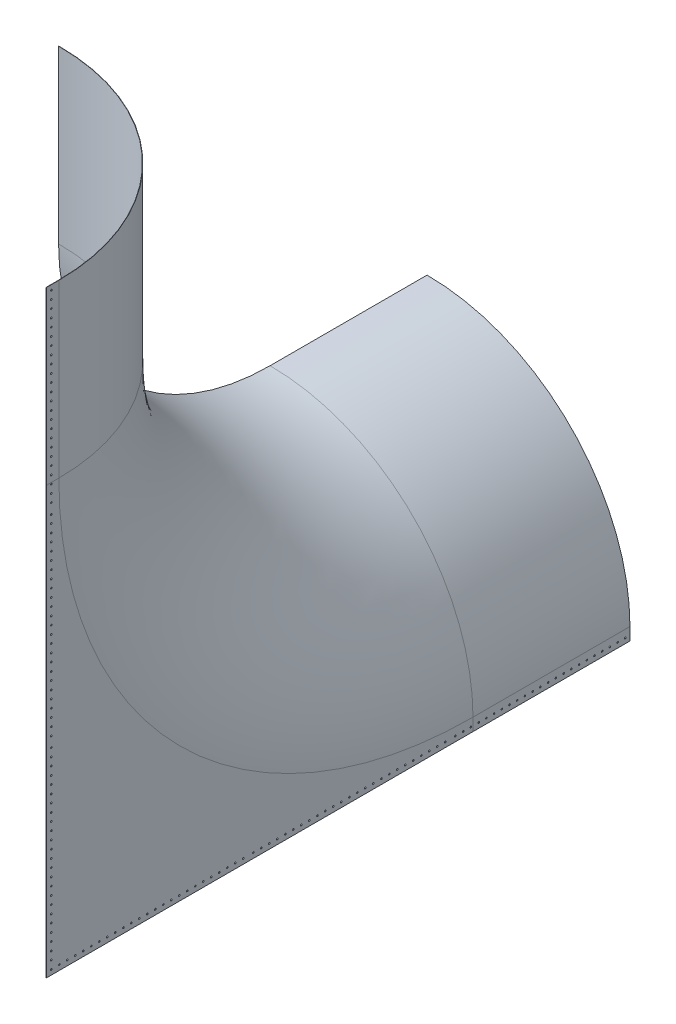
from build123d import *

# Parameters (mm, degrees)
BOSS_EXTRUDE1_DEPTH     = 1.5875
BOSS_EXTRUDE2_DEPTH     = 920.7377971
BOSS_EXTRUDE3_START     = 1006.9599971
BOSS_EXTRUDE3_DEPTH     = 1006.9599971
SKETCH3_R               = 4.826
CUT_EXTRUDE1_DEPTH      = 10
CUT_EXTRUDE2_DEPTH      = 4621.606419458
CUT_EXTRUDE2_DEPTH_BACK = 4621.606419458
SKETCH5_W               = 4335.241922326
SKETCH5_H               = 3795.113420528
CUT_EXTRUDE3_DEPTH      = 88


with BuildPart() as part:
    # Sweep1: sweep along a path in Corner Arch
    with BuildLine(Plane.YZ) as sweep1_path:
        Line((0, 0), (0, 75.7422029))
        ThreePointArc((0, 75.7422029), (731.881575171, 1842.660627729), (2498.8, 2574.5422029))
        Line((2498.8, 2574.5422029), (2574.5422029, 2574.5422029))
    # sk 48.2in rad pnl → Sweep1 (sweep)
    with BuildSketch(Plane(origin=(0, 0, 0), x_dir=(0, 1, 0), z_dir=(0, 0, 1))):
        with BuildLine():
            Line((1222.6925, 0), (1222.6925, 75.746594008))
            Line((1222.6925, 75.746594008), (1224.28, 75.746594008))
            Line((1224.28, 75.746594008), (1224.28, 0))
            ThreePointArc((1224.28, 0), (865.696690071, -865.696690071), (0, -1224.28))
            Line((0, -1224.28), (-75.737811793, -1224.28))
            Line((-75.737811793, -1224.28), (-75.737811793, -1222.6925))
            Line((-75.737811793, -1222.6925), (0, -1222.6925))
            ThreePointArc((0, -1222.6925), (864.574158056, -864.574158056), (1222.6925, 0))
        make_face()
    sweep(path=sweep1_path.line)

    # Sketch1 → Boss-Extrude1 (add)
    with BuildSketch(Plane.YZ.offset(1224.28)):
        with BuildLine():
            Line((2498.8, 2650.280014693), (-75.737811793, 2650.280014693))
            Line((-75.737811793, 2650.280014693), (-75.737811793, 75.7422029))
            ThreePointArc((-75.737811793, 75.7422029), (678.32685486, 1896.21534804), (2498.8, 2650.280014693))
        make_face()
    extrude(amount=-BOSS_EXTRUDE1_DEPTH)

    # sk 48.2in rad pnl_2 → Boss-Extrude2 (add)
    with BuildSketch(Plane(origin=(0, 0, 0), x_dir=(0, 1, 0), z_dir=(0, 0, 1))):
        with BuildLine():
            Line((1222.6925, 0), (1222.6925, 75.746594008))
            Line((1222.6925, 75.746594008), (1224.28, 75.746594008))
            Line((1224.28, 75.746594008), (1224.28, 0))
            ThreePointArc((1224.28, 0), (865.696690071, -865.696690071), (0, -1224.28))
            Line((0, -1224.28), (-75.737811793, -1224.28))
            Line((-75.737811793, -1224.28), (-75.737811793, -1222.6925))
            Line((-75.737811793, -1222.6925), (0, -1222.6925))
            ThreePointArc((0, -1222.6925), (864.574158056, -864.574158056), (1222.6925, 0))
        make_face()
    extrude(amount=-BOSS_EXTRUDE2_DEPTH)

    # Sketch2 → Boss-Extrude3 (add)
    with BuildSketch(Plane(origin=(0, 2574.5422029, 0), x_dir=(-1, 0, 0), z_dir=(0, 1, 0)).offset(BOSS_EXTRUDE3_START)):
        with BuildLine():
            Line((-1224.28, 2650.280014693), (-1224.28, 2574.5422029))
            ThreePointArc((-1224.28, 2574.5422029), (-865.696690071, 1708.845512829), (0, 1350.2622029))
            Line((0, 1350.2622029), (75.746594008, 1350.2622029))
            Line((75.746594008, 1350.2622029), (75.746594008, 1351.8497029))
            Line((75.746594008, 1351.8497029), (0, 1351.8497029))
            ThreePointArc((0, 1351.8497029), (-864.574158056, 1709.968044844), (-1222.6925, 2574.5422029))
            Line((-1222.6925, 2574.5422029), (-1222.6925, 2650.280014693))
            Line((-1222.6925, 2650.280014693), (-1224.28, 2650.280014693))
        make_face()
    extrude(amount=-BOSS_EXTRUDE3_DEPTH)

    # Sketch3 → Cut-Extrude1 (cut)
    with BuildSketch(Plane.YZ.offset(1224.28)):
        with Locations(Location((-45.435611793, -890.4355971, 0), (0, 0, 180))):
            Circle(SKETCH3_R)
        with Locations(Location((-45.435611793, -843.8183971, 0), (0, 0, 180))):
            Circle(SKETCH3_R)
        with Locations(Location((-45.435611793, -797.2011971, 0), (0, 0, 180))):
            Circle(SKETCH3_R)
        with Locations(Location((-45.435611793, -750.5839971, 0), (0, 0, 180))):
            Circle(SKETCH3_R)
        with Locations(Location((-45.435611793, -703.9667971, 0), (0, 0, 180))):
            Circle(SKETCH3_R)
        with Locations(Location((-45.435611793, -657.3495971, 0), (0, 0, 180))):
            Circle(SKETCH3_R)
        with Locations(Location((-45.435611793, -610.7323971, 0), (0, 0, 180))):
            Circle(SKETCH3_R)
        with Locations(Location((-45.435611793, -564.1151971, 0), (0, 0, 180))):
            Circle(SKETCH3_R)
        with Locations(Location((-45.435611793, -517.4979971, 0), (0, 0, 180))):
            Circle(SKETCH3_R)
        with Locations(Location((-45.435611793, -470.8807971, 0), (0, 0, 180))):
            Circle(SKETCH3_R)
        with Locations(Location((-45.435611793, -424.2635971, 0), (0, 0, 180))):
            Circle(SKETCH3_R)
        with Locations(Location((-45.435611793, -377.6463971, 0), (0, 0, 180))):
            Circle(SKETCH3_R)
        with Locations(Location((-45.435611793, -331.0291971, 0), (0, 0, 180))):
            Circle(SKETCH3_R)
        with Locations(Location((-45.435611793, -284.4119971, 0), (0, 0, 180))):
            Circle(SKETCH3_R)
        with Locations(Location((-45.435611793, -237.7947971, 0), (0, 0, 180))):
            Circle(SKETCH3_R)
        with Locations(Location((-45.435611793, -191.1775971, 0), (0, 0, 180))):
            Circle(SKETCH3_R)
        with Locations(Location((-45.435611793, -144.5603971, 0), (0, 0, 180))):
            Circle(SKETCH3_R)
        with Locations(Location((-45.435611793, -97.9431971, 0), (0, 0, 180))):
            Circle(SKETCH3_R)
        with Locations(Location((-45.435611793, -51.3259971, 0), (0, 0, 180))):
            Circle(SKETCH3_R)
        with Locations(Location((-45.435611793, -4.7087971, 0), (0, 0, 180))):
            Circle(SKETCH3_R)
        with Locations(Location((-45.435611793, 41.9084029, 0), (0, 0, 180))):
            Circle(SKETCH3_R)
        with Locations(Location((-45.435611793, 88.5256029, 0), (0, 0, 180))):
            Circle(SKETCH3_R)
        with Locations(Location((-45.435611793, 135.1428029, 0), (0, 0, 180))):
            Circle(SKETCH3_R)
        with Locations(Location((-45.435611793, 181.7600029, 0), (0, 0, 180))):
            Circle(SKETCH3_R)
        with Locations(Location((-45.435611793, 242.7200029, 0), (0, 0, 180))):
            Circle(SKETCH3_R)
        with Locations(Location((-45.435611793, 290.9800029, 0), (0, 0, 180))):
            Circle(SKETCH3_R)
        with Locations(Location((-45.435611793, 339.2400029, 0), (0, 0, 180))):
            Circle(SKETCH3_R)
        with Locations(Location((-45.435611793, 387.5000029, 0), (0, 0, 180))):
            Circle(SKETCH3_R)
        with Locations(Location((-45.435611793, 435.7600029, 0), (0, 0, 180))):
            Circle(SKETCH3_R)
        with Locations(Location((-45.435611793, 484.0200029, 0), (0, 0, 180))):
            Circle(SKETCH3_R)
        with Locations(Location((-45.435611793, 532.2800029, 0), (0, 0, 180))):
            Circle(SKETCH3_R)
        with Locations(Location((-45.435611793, 580.5400029, 0), (0, 0, 180))):
            Circle(SKETCH3_R)
        with Locations(Location((-45.435611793, 628.8000029, 0), (0, 0, 180))):
            Circle(SKETCH3_R)
        with Locations(Location((-45.435611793, 677.0600029, 0), (0, 0, 180))):
            Circle(SKETCH3_R)
        with Locations(Location((-45.435611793, 725.3200029, 0), (0, 0, 180))):
            Circle(SKETCH3_R)
        with Locations(Location((-45.435611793, 773.5800029, 0), (0, 0, 180))):
            Circle(SKETCH3_R)
        with Locations(Location((-45.435611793, 821.8400029, 0), (0, 0, 180))):
            Circle(SKETCH3_R)
        with Locations(Location((-45.435611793, 870.1000029, 0), (0, 0, 180))):
            Circle(SKETCH3_R)
        with Locations(Location((-45.435611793, 918.3600029, 0), (0, 0, 180))):
            Circle(SKETCH3_R)
        with Locations(Location((-45.435611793, 966.6200029, 0), (0, 0, 180))):
            Circle(SKETCH3_R)
        with Locations(Location((-45.435611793, 1014.8800029, 0), (0, 0, 180))):
            Circle(SKETCH3_R)
        with Locations(Location((-45.435611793, 1063.1400029, 0), (0, 0, 180))):
            Circle(SKETCH3_R)
        with Locations(Location((-45.435611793, 1111.4000029, 0), (0, 0, 180))):
            Circle(SKETCH3_R)
        with Locations(Location((-45.435611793, 1159.6600029, 0), (0, 0, 180))):
            Circle(SKETCH3_R)
        with Locations(Location((-45.435611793, 1207.9200029, 0), (0, 0, 180))):
            Circle(SKETCH3_R)
        with Locations(Location((-45.435611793, 1256.1800029, 0), (0, 0, 180))):
            Circle(SKETCH3_R)
        with Locations(Location((-45.435611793, 1304.4400029, 0), (0, 0, 180))):
            Circle(SKETCH3_R)
        with Locations(Location((-45.435611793, 1352.7000029, 0), (0, 0, 180))):
            Circle(SKETCH3_R)
        with Locations(Location((-45.435611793, 1400.9600029, 0), (0, 0, 180))):
            Circle(SKETCH3_R)
        with Locations(Location((-45.435611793, 1461.7422029, 0), (0, 0, 180))):
            Circle(SKETCH3_R)
        with Locations(Location((-45.435611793, 1510.0022029, 0), (0, 0, 180))):
            Circle(SKETCH3_R)
        with Locations(Location((-45.435611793, 1558.2622029, 0), (0, 0, 180))):
            Circle(SKETCH3_R)
        with Locations(Location((-45.435611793, 1606.5222029, 0), (0, 0, 180))):
            Circle(SKETCH3_R)
        with Locations(Location((-45.435611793, 1654.7822029, 0), (0, 0, 180))):
            Circle(SKETCH3_R)
        with Locations(Location((-45.435611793, 1703.0422029, 0), (0, 0, 180))):
            Circle(SKETCH3_R)
        with Locations(Location((-45.435611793, 1751.3022029, 0), (0, 0, 180))):
            Circle(SKETCH3_R)
        with Locations(Location((-45.435611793, 1799.5622029, 0), (0, 0, 180))):
            Circle(SKETCH3_R)
        with Locations(Location((-45.435611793, 1847.8222029, 0), (0, 0, 180))):
            Circle(SKETCH3_R)
        with Locations(Location((-45.435611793, 1896.0822029, 0), (0, 0, 180))):
            Circle(SKETCH3_R)
        with Locations(Location((-45.435611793, 1944.3422029, 0), (0, 0, 180))):
            Circle(SKETCH3_R)
        with Locations(Location((-45.435611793, 1992.6022029, 0), (0, 0, 180))):
            Circle(SKETCH3_R)
        with Locations(Location((-45.435611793, 2040.8622029, 0), (0, 0, 180))):
            Circle(SKETCH3_R)
        with Locations(Location((-45.435611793, 2089.1222029, 0), (0, 0, 180))):
            Circle(SKETCH3_R)
        with Locations(Location((-45.435611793, 2137.3822029, 0), (0, 0, 180))):
            Circle(SKETCH3_R)
        with Locations(Location((-45.435611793, 2185.6422029, 0), (0, 0, 180))):
            Circle(SKETCH3_R)
        with Locations(Location((-45.435611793, 2233.9022029, 0), (0, 0, 180))):
            Circle(SKETCH3_R)
        with Locations(Location((-45.435611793, 2282.1622029, 0), (0, 0, 180))):
            Circle(SKETCH3_R)
        with Locations(Location((-45.435611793, 2330.4222029, 0), (0, 0, 180))):
            Circle(SKETCH3_R)
        with Locations(Location((-45.435611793, 2378.6822029, 0), (0, 0, 180))):
            Circle(SKETCH3_R)
        with Locations(Location((-45.435611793, 2426.9422029, 0), (0, 0, 180))):
            Circle(SKETCH3_R)
        with Locations(Location((-45.435611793, 2475.2022029, 0), (0, 0, 180))):
            Circle(SKETCH3_R)
        with Locations(Location((-45.435611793, 2523.4622029, 0), (0, 0, 180))):
            Circle(SKETCH3_R)
        with Locations(Location((-45.435611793, 2571.7222029, 0), (0, 0, 180))):
            Circle(SKETCH3_R)
        with Locations(Location((-45.435611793, 2619.9822029, 0), (0, 0, 180))):
            Circle(SKETCH3_R)
        with Locations(Location((2.828782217, 2619.9822029, 0), (0, 0, 180))):
            Circle(SKETCH3_R)
        with Locations(Location((51.088782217, 2619.9822029, 0), (0, 0, 180))):
            Circle(SKETCH3_R)
        with Locations(Location((99.348782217, 2619.9822029, 0), (0, 0, 180))):
            Circle(SKETCH3_R)
        with Locations(Location((147.608782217, 2619.9822029, 0), (0, 0, 180))):
            Circle(SKETCH3_R)
        with Locations(Location((195.868782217, 2619.9822029, 0), (0, 0, 180))):
            Circle(SKETCH3_R)
        with Locations(Location((244.128782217, 2619.9822029, 0), (0, 0, 180))):
            Circle(SKETCH3_R)
        with Locations(Location((292.388782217, 2619.9822029, 0), (0, 0, 180))):
            Circle(SKETCH3_R)
        with Locations(Location((340.648782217, 2619.9822029, 0), (0, 0, 180))):
            Circle(SKETCH3_R)
        with Locations(Location((388.908782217, 2619.9822029, 0), (0, 0, 180))):
            Circle(SKETCH3_R)
        with Locations(Location((437.168782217, 2619.9822029, 0), (0, 0, 180))):
            Circle(SKETCH3_R)
        with Locations(Location((485.428782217, 2619.9822029, 0), (0, 0, 180))):
            Circle(SKETCH3_R)
        with Locations(Location((533.688782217, 2619.9822029, 0), (0, 0, 180))):
            Circle(SKETCH3_R)
        with Locations(Location((581.948782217, 2619.9822029, 0), (0, 0, 180))):
            Circle(SKETCH3_R)
        with Locations(Location((630.208782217, 2619.9822029, 0), (0, 0, 180))):
            Circle(SKETCH3_R)
        with Locations(Location((678.468782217, 2619.9822029, 0), (0, 0, 180))):
            Circle(SKETCH3_R)
        with Locations(Location((726.728782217, 2619.9822029, 0), (0, 0, 180))):
            Circle(SKETCH3_R)
        with Locations(Location((774.988782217, 2619.9822029, 0), (0, 0, 180))):
            Circle(SKETCH3_R)
        with Locations(Location((823.248782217, 2619.9822029, 0), (0, 0, 180))):
            Circle(SKETCH3_R)
        with Locations(Location((871.508782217, 2619.9822029, 0), (0, 0, 180))):
            Circle(SKETCH3_R)
        with Locations(Location((919.768782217, 2619.9822029, 0), (0, 0, 180))):
            Circle(SKETCH3_R)
        with Locations(Location((968.028782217, 2619.9822029, 0), (0, 0, 180))):
            Circle(SKETCH3_R)
        with Locations(Location((1016.288782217, 2619.9822029, 0), (0, 0, 180))):
            Circle(SKETCH3_R)
        with Locations(Location((1064.548782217, 2619.9822029, 0), (0, 0, 180))):
            Circle(SKETCH3_R)
        with Locations(Location((1112.808782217, 2619.9822029, 0), (0, 0, 180))):
            Circle(SKETCH3_R)
        with Locations(Location((1173.768782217, 2619.9822029, 0), (0, 0, 180))):
            Circle(SKETCH3_R)
        with Locations(Location((1222.028782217, 2619.9822029, 0), (0, 0, 180))):
            Circle(SKETCH3_R)
        with Locations(Location((1270.288782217, 2619.9822029, 0), (0, 0, 180))):
            Circle(SKETCH3_R)
        with Locations(Location((1318.548782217, 2619.9822029, 0), (0, 0, 180))):
            Circle(SKETCH3_R)
        with Locations(Location((1366.808782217, 2619.9822029, 0), (0, 0, 180))):
            Circle(SKETCH3_R)
        with Locations(Location((1415.068782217, 2619.9822029, 0), (0, 0, 180))):
            Circle(SKETCH3_R)
        with Locations(Location((1463.328782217, 2619.9822029, 0), (0, 0, 180))):
            Circle(SKETCH3_R)
        with Locations(Location((1511.588782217, 2619.9822029, 0), (0, 0, 180))):
            Circle(SKETCH3_R)
        with Locations(Location((1559.848782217, 2619.9822029, 0), (0, 0, 180))):
            Circle(SKETCH3_R)
        with Locations(Location((1608.108782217, 2619.9822029, 0), (0, 0, 180))):
            Circle(SKETCH3_R)
        with Locations(Location((1656.368782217, 2619.9822029, 0), (0, 0, 180))):
            Circle(SKETCH3_R)
        with Locations(Location((1704.628782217, 2619.9822029, 0), (0, 0, 180))):
            Circle(SKETCH3_R)
        with Locations(Location((1752.888782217, 2619.9822029, 0), (0, 0, 180))):
            Circle(SKETCH3_R)
        with Locations(Location((1801.148782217, 2619.9822029, 0), (0, 0, 180))):
            Circle(SKETCH3_R)
        with Locations(Location((1849.408782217, 2619.9822029, 0), (0, 0, 180))):
            Circle(SKETCH3_R)
        with Locations(Location((1897.668782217, 2619.9822029, 0), (0, 0, 180))):
            Circle(SKETCH3_R)
        with Locations(Location((1945.928782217, 2619.9822029, 0), (0, 0, 180))):
            Circle(SKETCH3_R)
        with Locations(Location((1994.188782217, 2619.9822029, 0), (0, 0, 180))):
            Circle(SKETCH3_R)
        with Locations(Location((2042.448782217, 2619.9822029, 0), (0, 0, 180))):
            Circle(SKETCH3_R)
        with Locations(Location((2090.708782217, 2619.9822029, 0), (0, 0, 180))):
            Circle(SKETCH3_R)
        with Locations(Location((2138.968782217, 2619.9822029, 0), (0, 0, 180))):
            Circle(SKETCH3_R)
        with Locations(Location((2187.228782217, 2619.9822029, 0), (0, 0, 180))):
            Circle(SKETCH3_R)
        with Locations(Location((2235.488782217, 2619.9822029, 0), (0, 0, 180))):
            Circle(SKETCH3_R)
        with Locations(Location((2283.748782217, 2619.9822029, 0), (0, 0, 180))):
            Circle(SKETCH3_R)
        with Locations(Location((2332.008782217, 2619.9822029, 0), (0, 0, 180))):
            Circle(SKETCH3_R)
        with Locations(Location((2392.968782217, 2619.9822029, 0), (0, 0, 180))):
            Circle(SKETCH3_R)
        with Locations(Location((2441.228782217, 2619.9822029, 0), (0, 0, 180))):
            Circle(SKETCH3_R)
        with Locations(Location((2489.488782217, 2619.9822029, 0), (0, 0, 180))):
            Circle(SKETCH3_R)
        with Locations(Location((2537.748782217, 2619.9822029, 0), (0, 0, 180))):
            Circle(SKETCH3_R)
        with Locations(Location((2586.008782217, 2619.9822029, 0), (0, 0, 180))):
            Circle(SKETCH3_R)
        with Locations(Location((2634.268782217, 2619.9822029, 0), (0, 0, 180))):
            Circle(SKETCH3_R)
        with Locations(Location((2682.528782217, 2619.9822029, 0), (0, 0, 180))):
            Circle(SKETCH3_R)
        with Locations(Location((2730.788782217, 2619.9822029, 0), (0, 0, 180))):
            Circle(SKETCH3_R)
        with Locations(Location((2779.048782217, 2619.9822029, 0), (0, 0, 180))):
            Circle(SKETCH3_R)
        with Locations(Location((2827.308782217, 2619.9822029, 0), (0, 0, 180))):
            Circle(SKETCH3_R)
        with Locations(Location((2875.568782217, 2619.9822029, 0), (0, 0, 180))):
            Circle(SKETCH3_R)
        with Locations(Location((2923.828782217, 2619.9822029, 0), (0, 0, 180))):
            Circle(SKETCH3_R)
        with Locations(Location((2972.088782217, 2619.9822029, 0), (0, 0, 180))):
            Circle(SKETCH3_R)
        with Locations(Location((3020.348782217, 2619.9822029, 0), (0, 0, 180))):
            Circle(SKETCH3_R)
        with Locations(Location((3068.608782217, 2619.9822029, 0), (0, 0, 180))):
            Circle(SKETCH3_R)
        with Locations(Location((3116.868782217, 2619.9822029, 0), (0, 0, 180))):
            Circle(SKETCH3_R)
        with Locations(Location((3165.128782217, 2619.9822029, 0), (0, 0, 180))):
            Circle(SKETCH3_R)
        with Locations(Location((3213.388782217, 2619.9822029, 0), (0, 0, 180))):
            Circle(SKETCH3_R)
        with Locations(Location((3261.648782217, 2619.9822029, 0), (0, 0, 180))):
            Circle(SKETCH3_R)
        with Locations(Location((3309.908782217, 2619.9822029, 0), (0, 0, 180))):
            Circle(SKETCH3_R)
        with Locations(Location((3358.168782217, 2619.9822029, 0), (0, 0, 180))):
            Circle(SKETCH3_R)
        with Locations(Location((3406.428782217, 2619.9822029, 0), (0, 0, 180))):
            Circle(SKETCH3_R)
        with Locations(Location((3454.688782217, 2619.9822029, 0), (0, 0, 180))):
            Circle(SKETCH3_R)
        with Locations(Location((3502.948782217, 2619.9822029, 0), (0, 0, 180))):
            Circle(SKETCH3_R)
        with Locations(Location((3551.208782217, 2619.9822029, 0), (0, 0, 180))):
            Circle(SKETCH3_R)
    extrude(amount=-CUT_EXTRUDE1_DEPTH, mode=Mode.SUBTRACT)

    # Sketch4 → Cut-Extrude2 (cut, two sides: drawn at the far end of the back side and taken through both)
    with BuildSketch(Plane.YZ.offset(-CUT_EXTRUDE2_DEPTH_BACK)):
        Polygon((3532.15, 2838.149337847), (3807.151262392, 2838.149337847), (3807.151262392, -1062.099116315), (-165.760293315, -1062.099116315), (-165.760293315, -871.3855971), (3532.15, -871.3855971), align=None)
    extrude(amount=CUT_EXTRUDE2_DEPTH + CUT_EXTRUDE2_DEPTH_BACK, mode=Mode.SUBTRACT)

    # Sketch5 → Cut-Extrude3 (cut)
    with BuildSketch(Plane.YZ):
        with Locations((1671.350462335, 949.85631755)):
            Rectangle(SKETCH5_W, SKETCH5_H)
    extrude(amount=-CUT_EXTRUDE3_DEPTH, mode=Mode.SUBTRACT)


solid = part.part
